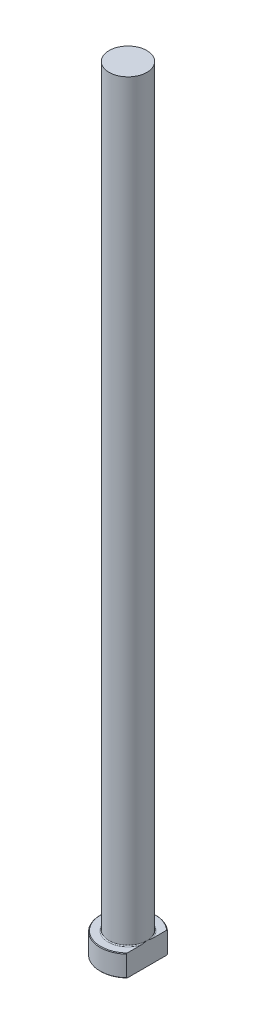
from build123d import *
from build123d.topology import SkipClean

# Parameters (mm, degrees)
CHAMFER1_SIZE = 0.2
FILLET1_R     = 0.3
KEY_DEPTH     = 251.32379032


with BuildPart() as part:
    # Sketch1 → Revolve1 (revolve)
    with BuildSketch(Plane.XY, mode=Mode.PRIVATE) as revolve1_sk:
        Polygon((0, 0), (-9, 0), (-9, 7), (-6.1, 7), (-6.1, 250), (0, 250), align=None)
    revolve(revolve1_sk.sketch.rotate(Axis((0, 259.958771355, 0), (0, -1, 0)), 270), axis=Axis((0, 259.958771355, 0), (0, -1, 0)))

    # Chamfer1
    chamfer1_edges = [part.edges().sort_by_distance(p)[0] for p in [
        (0, 7, -9),
        (0, 0, -9),
    ]]
    chamfer(chamfer1_edges, length=CHAMFER1_SIZE)

    # Fillet1
    fillet1_edges = [part.edges().sort_by_distance(p)[0] for p in [
        (0, 7, -6.1),
    ]]
    fillet(fillet1_edges, radius=FILLET1_R)

    # Sketch2 → KEY (cut, through all)
    with SkipClean():  # the faces are left unmerged after this step: merging them gives an invalid solid
        with BuildSketch(Plane(origin=(0, 0, 0), x_dir=(1, 0, 0), z_dir=(0, 1, 0))):
            with BuildLine():
                Line((6.1, 6.617401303), (6.1, -6.617401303))
                ThreePointArc((6.1, -6.617401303), (9, 0), (6.1, 6.617401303))
            make_face()
        extrude(amount=KEY_DEPTH, mode=Mode.SUBTRACT)


solid = part.part
